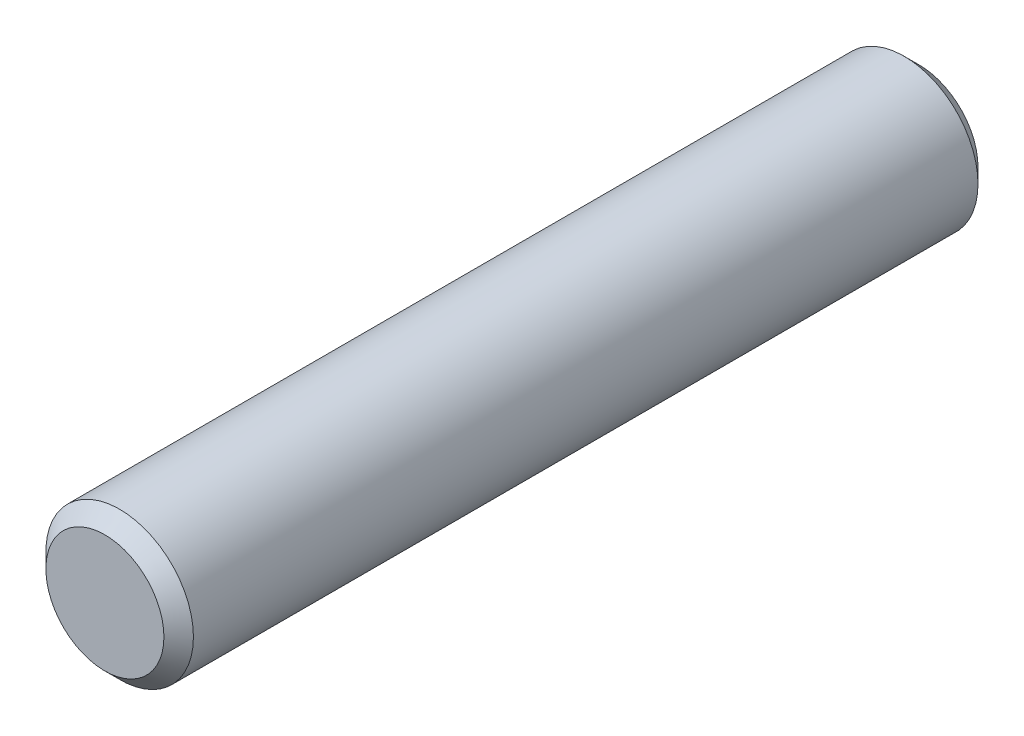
from build123d import *

# Parameters (mm, degrees)
SKETCH5_R          = 63.5
TYPE4_DEPTH        = 322.050775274
TYPE4_CHAMFER_SIZE = 0.635254


with BuildPart() as part:
    # Sketch1 → Revolve1 (revolve)
    with BuildSketch(Plane(origin=(0, 0, 0), x_dir=(0, 0, -1), z_dir=(1, 0, 0)), mode=Mode.PRIVATE) as revolve1_sk:
        Polygon((0, 0), (0, 2.541016), (0.635254, 3.17627), (35.052, 3.17627), (35.052, 2.541016), (35.687254, 3.17627), (330.2, 3.17627), (330.2, 11.43), (332.74, 12.7), (353.06, 12.7), (355.6, 10.16), (355.6, 0), align=None)
    revolve(revolve1_sk.sketch.rotate(Axis((0, 0, 0), (0, 0, -1)), 90), axis=Axis((0, 0, 0), (0, 0, -1)))

    # Sketch5 → Type4 (cut, through all)
    with BuildSketch(Plane(origin=(0, 0, -35.052), x_dir=(-1, 0, 0), z_dir=(0, 0, -1))):
        Circle(SKETCH5_R)
    extrude(amount=TYPE4_DEPTH, mode=Mode.SUBTRACT)

    # Type4-Chamfer
    type4_chamfer_edges = [part.edges().sort_by_distance(p)[0] for p in [
        (-3.17627, 0, -35.052),
    ]]
    chamfer(type4_chamfer_edges, length=TYPE4_CHAMFER_SIZE)


solid = part.part
